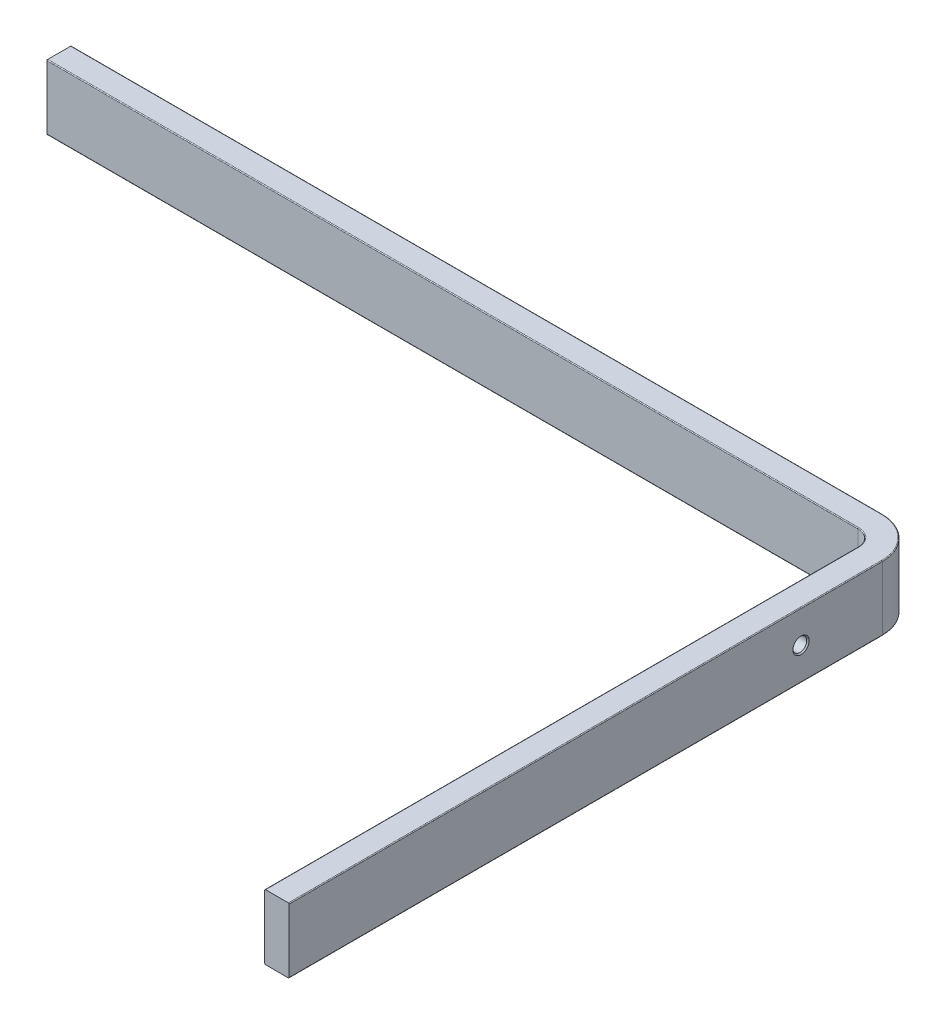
ISO-10303-21;
HEADER;
FILE_DESCRIPTION(('STEP AP214'),'2;1');
FILE_NAME('part.step','',(''),(''),'','','');
FILE_SCHEMA(('AUTOMOTIVE_DESIGN { 1 0 10303 214 1 1 1 1 }'));
ENDSEC;
DATA;
#1=APPLICATION_CONTEXT('core data for automotive mechanical design processes');
#2=APPLICATION_PROTOCOL_DEFINITION('international standard','automotive_design',2000,#1);
#3=PRODUCT_CONTEXT('',#1,'mechanical');
#4=PRODUCT('Part','Part','',(#3));
#5=PRODUCT_RELATED_PRODUCT_CATEGORY('part','',(#4));
#6=PRODUCT_DEFINITION_FORMATION('','',#4);
#7=PRODUCT_DEFINITION_CONTEXT('part definition',#1,'design');
#8=PRODUCT_DEFINITION('design','',#6,#7);
#9=PRODUCT_DEFINITION_SHAPE('','',#8);
#10=(LENGTH_UNIT() NAMED_UNIT(*) SI_UNIT(.MILLI.,.METRE.));
#11=(NAMED_UNIT(*) PLANE_ANGLE_UNIT() SI_UNIT($,.RADIAN.));
#12=(NAMED_UNIT(*) SI_UNIT($,.STERADIAN.) SOLID_ANGLE_UNIT());
#13=UNCERTAINTY_MEASURE_WITH_UNIT(LENGTH_MEASURE(1.E-05),#10,'distance_accuracy_value','');
#14=(GEOMETRIC_REPRESENTATION_CONTEXT(3) GLOBAL_UNCERTAINTY_ASSIGNED_CONTEXT((#13)) GLOBAL_UNIT_ASSIGNED_CONTEXT((#10,
#11,#12)) REPRESENTATION_CONTEXT('',''));
#15=CARTESIAN_POINT('',(0.,0.,0.));
#16=DIRECTION('',(0.,0.,1.));
#17=DIRECTION('',(1.,0.,0.));
#18=AXIS2_PLACEMENT_3D('',#15,#16,#17);
#19=CARTESIAN_POINT('',(0.,-20.,390.));
#20=DIRECTION('',(1.,0.,0.));
#21=DIRECTION('',(0.,0.,-1.));
#22=AXIS2_PLACEMENT_3D('',#19,#20,#21);
#23=PLANE('',#22);
#24=CARTESIAN_POINT('',(0.,0.,75.));
#25=DIRECTION('',(1.,0.,0.));
#26=DIRECTION('',(0.,0.,-1.));
#27=AXIS2_PLACEMENT_3D('',#24,#25,#26);
#28=CIRCLE('',#27,4.99999999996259);
#29=CARTESIAN_POINT('',(0.,0.,70.0000000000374));
#30=VERTEX_POINT('',#29);
#31=EDGE_CURVE('E212',#30,#30,#28,.F.);
#32=ORIENTED_EDGE('',*,*,#31,.T.);
#33=EDGE_LOOP('',(#32));
#34=FACE_BOUND('',#33,.T.);
#35=DIRECTION('',(0.,1.,0.));
#36=VECTOR('',#35,1.);
#37=CARTESIAN_POINT('',(0.,-20.,390.));
#38=LINE('',#37,#36);
#39=CARTESIAN_POINT('',(0.,-19.5,390.));
#40=VERTEX_POINT('',#39);
#41=CARTESIAN_POINT('',(0.,19.5,390.));
#42=VERTEX_POINT('',#41);
#43=EDGE_CURVE('E333',#40,#42,#38,.T.);
#44=ORIENTED_EDGE('',*,*,#43,.F.);
#45=DIRECTION('',(0.,0.,-1.));
#46=VECTOR('',#45,1.);
#47=CARTESIAN_POINT('',(0.,-19.5,25.));
#48=LINE('',#47,#46);
#49=CARTESIAN_POINT('',(0.,-19.5,25.));
#50=VERTEX_POINT('',#49);
#51=EDGE_CURVE('E256',#40,#50,#48,.T.);
#52=ORIENTED_EDGE('',*,*,#51,.T.);
#53=DIRECTION('',(0.,1.,0.));
#54=VECTOR('',#53,1.);
#55=CARTESIAN_POINT('',(0.,-20.,25.));
#56=LINE('',#55,#54);
#57=CARTESIAN_POINT('',(0.,19.5,25.));
#58=VERTEX_POINT('',#57);
#59=EDGE_CURVE('E336',#50,#58,#56,.T.);
#60=ORIENTED_EDGE('',*,*,#59,.T.);
#61=DIRECTION('',(0.,0.,-1.));
#62=VECTOR('',#61,1.);
#63=CARTESIAN_POINT('',(0.,19.5,390.));
#64=LINE('',#63,#62);
#65=EDGE_CURVE('E254',#58,#42,#64,.F.);
#66=ORIENTED_EDGE('',*,*,#65,.T.);
#67=EDGE_LOOP('',(#44,#52,#60,#66));
#68=FACE_BOUND('',#67,.T.);
#69=ADVANCED_FACE('F32',(#34,#68),#23,.T.);
#70=CARTESIAN_POINT('',(-525.,-20.,390.));
#71=DIRECTION('',(0.,0.,1.));
#72=DIRECTION('',(1.,0.,0.));
#73=AXIS2_PLACEMENT_3D('',#70,#71,#72);
#74=PLANE('',#73);
#75=DIRECTION('',(1.,0.,0.));
#76=VECTOR('',#75,1.);
#77=CARTESIAN_POINT('',(-525.,-20.,390.));
#78=LINE('',#77,#76);
#79=CARTESIAN_POINT('',(-14.5,-20.,390.));
#80=VERTEX_POINT('',#79);
#81=CARTESIAN_POINT('',(-0.499999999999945,-20.,390.));
#82=VERTEX_POINT('',#81);
#83=EDGE_CURVE('E344',#80,#82,#78,.T.);
#84=ORIENTED_EDGE('',*,*,#83,.T.);
#85=CARTESIAN_POINT('',(-0.5,-19.5,390.));
#86=DIRECTION('',(0.,0.,1.));
#87=DIRECTION('',(1.,0.,0.));
#88=AXIS2_PLACEMENT_3D('',#85,#86,#87);
#89=CIRCLE('',#88,0.5);
#90=EDGE_CURVE('E264',#82,#40,#89,.T.);
#91=ORIENTED_EDGE('',*,*,#90,.T.);
#92=ORIENTED_EDGE('',*,*,#43,.T.);
#93=CARTESIAN_POINT('',(-0.5,19.5,390.));
#94=DIRECTION('',(0.,0.,1.));
#95=DIRECTION('',(1.,0.,0.));
#96=AXIS2_PLACEMENT_3D('',#93,#94,#95);
#97=CIRCLE('',#96,0.5);
#98=CARTESIAN_POINT('',(-0.499999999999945,20.,390.));
#99=VERTEX_POINT('',#98);
#100=EDGE_CURVE('E258',#42,#99,#97,.T.);
#101=ORIENTED_EDGE('',*,*,#100,.T.);
#102=DIRECTION('',(1.,0.,0.));
#103=VECTOR('',#102,1.);
#104=CARTESIAN_POINT('',(-525.,20.,390.));
#105=LINE('',#104,#103);
#106=CARTESIAN_POINT('',(-14.5,20.,390.));
#107=VERTEX_POINT('',#106);
#108=EDGE_CURVE('E349',#107,#99,#105,.T.);
#109=ORIENTED_EDGE('',*,*,#108,.F.);
#110=CARTESIAN_POINT('',(-14.5,19.5,390.));
#111=DIRECTION('',(0.,0.,1.));
#112=DIRECTION('',(1.,0.,0.));
#113=AXIS2_PLACEMENT_3D('',#110,#111,#112);
#114=CIRCLE('',#113,0.5);
#115=CARTESIAN_POINT('',(-15.,19.5,390.));
#116=VERTEX_POINT('',#115);
#117=EDGE_CURVE('E260',#107,#116,#114,.T.);
#118=ORIENTED_EDGE('',*,*,#117,.T.);
#119=DIRECTION('',(0.,-1.,0.));
#120=VECTOR('',#119,1.);
#121=CARTESIAN_POINT('',(-15.,20.,390.));
#122=LINE('',#121,#120);
#123=CARTESIAN_POINT('',(-15.,-19.5,390.));
#124=VERTEX_POINT('',#123);
#125=EDGE_CURVE('E218',#116,#124,#122,.T.);
#126=ORIENTED_EDGE('',*,*,#125,.T.);
#127=CARTESIAN_POINT('',(-14.5,-19.5,390.));
#128=DIRECTION('',(0.,0.,1.));
#129=DIRECTION('',(1.,0.,0.));
#130=AXIS2_PLACEMENT_3D('',#127,#128,#129);
#131=CIRCLE('',#130,0.5);
#132=EDGE_CURVE('E262',#124,#80,#131,.T.);
#133=ORIENTED_EDGE('',*,*,#132,.T.);
#134=EDGE_LOOP('',(#84,#91,#92,#101,#109,#118,#126,#133));
#135=FACE_BOUND('',#134,.T.);
#136=ADVANCED_FACE('F339',(#135),#74,.T.);
#137=CARTESIAN_POINT('',(-525.,-20.,0.));
#138=DIRECTION('',(-1.,0.,0.));
#139=DIRECTION('',(0.,0.,1.));
#140=AXIS2_PLACEMENT_3D('',#137,#138,#139);
#141=PLANE('',#140);
#142=DIRECTION('',(0.,0.,-1.));
#143=VECTOR('',#142,1.);
#144=CARTESIAN_POINT('',(-525.,18.9999999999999,0.));
#145=LINE('',#144,#143);
#146=CARTESIAN_POINT('',(-525.,18.9999999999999,13.9999999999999));
#147=VERTEX_POINT('',#146);
#148=CARTESIAN_POINT('',(-525.,18.9999999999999,1.00000000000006));
#149=VERTEX_POINT('',#148);
#150=EDGE_CURVE('E198',#147,#149,#145,.T.);
#151=ORIENTED_EDGE('',*,*,#150,.T.);
#152=DIRECTION('',(0.,-1.,0.));
#153=VECTOR('',#152,1.);
#154=CARTESIAN_POINT('',(-525.,-20.,1.00000000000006));
#155=LINE('',#154,#153);
#156=CARTESIAN_POINT('',(-525.,-18.9999999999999,1.00000000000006));
#157=VERTEX_POINT('',#156);
#158=EDGE_CURVE('E178',#149,#157,#155,.T.);
#159=ORIENTED_EDGE('',*,*,#158,.T.);
#160=DIRECTION('',(0.,0.,1.));
#161=VECTOR('',#160,1.);
#162=CARTESIAN_POINT('',(-525.,-18.9999999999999,15.));
#163=LINE('',#162,#161);
#164=CARTESIAN_POINT('',(-525.,-18.9999999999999,13.9999999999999));
#165=VERTEX_POINT('',#164);
#166=EDGE_CURVE('E187',#157,#165,#163,.T.);
#167=ORIENTED_EDGE('',*,*,#166,.T.);
#168=DIRECTION('',(0.,1.,0.));
#169=VECTOR('',#168,1.);
#170=CARTESIAN_POINT('',(-525.,20.,13.9999999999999));
#171=LINE('',#170,#169);
#172=EDGE_CURVE('E193',#165,#147,#171,.T.);
#173=ORIENTED_EDGE('',*,*,#172,.T.);
#174=EDGE_LOOP('',(#151,#159,#167,#173));
#175=FACE_BOUND('',#174,.T.);
#176=ADVANCED_FACE('F196',(#175),#141,.T.);
#177=CARTESIAN_POINT('',(0.,-20.,0.));
#178=DIRECTION('',(0.,0.,-1.));
#179=DIRECTION('',(-1.,0.,0.));
#180=AXIS2_PLACEMENT_3D('',#177,#178,#179);
#181=PLANE('',#180);
#182=DIRECTION('',(0.,1.,0.));
#183=VECTOR('',#182,1.);
#184=CARTESIAN_POINT('',(-25.,-20.,0.));
#185=LINE('',#184,#183);
#186=CARTESIAN_POINT('',(-25.,19.5,0.));
#187=VERTEX_POINT('',#186);
#188=CARTESIAN_POINT('',(-25.,-19.5,0.));
#189=VERTEX_POINT('',#188);
#190=EDGE_CURVE('E356',#187,#189,#185,.F.);
#191=ORIENTED_EDGE('',*,*,#190,.T.);
#192=DIRECTION('',(-1.,0.,0.));
#193=VECTOR('',#192,1.);
#194=CARTESIAN_POINT('',(-524.,-19.5,0.));
#195=LINE('',#194,#193);
#196=CARTESIAN_POINT('',(-524.,-19.5,0.));
#197=VERTEX_POINT('',#196);
#198=EDGE_CURVE('E232',#189,#197,#195,.T.);
#199=ORIENTED_EDGE('',*,*,#198,.T.);
#200=DIRECTION('',(0.,1.,0.));
#201=VECTOR('',#200,1.);
#202=CARTESIAN_POINT('',(-524.,-20.,0.));
#203=LINE('',#202,#201);
#204=CARTESIAN_POINT('',(-524.,19.5,0.));
#205=VERTEX_POINT('',#204);
#206=EDGE_CURVE('E194',#197,#205,#203,.T.);
#207=ORIENTED_EDGE('',*,*,#206,.T.);
#208=DIRECTION('',(-1.,0.,0.));
#209=VECTOR('',#208,1.);
#210=CARTESIAN_POINT('',(0.,19.5,0.));
#211=LINE('',#210,#209);
#212=EDGE_CURVE('E230',#205,#187,#211,.F.);
#213=ORIENTED_EDGE('',*,*,#212,.T.);
#214=EDGE_LOOP('',(#191,#199,#207,#213));
#215=FACE_BOUND('',#214,.T.);
#216=ADVANCED_FACE('F373',(#215),#181,.T.);
#217=CARTESIAN_POINT('',(0.,-20.,0.));
#218=DIRECTION('',(0.,1.,0.));
#219=DIRECTION('',(0.,0.,1.));
#220=AXIS2_PLACEMENT_3D('',#217,#218,#219);
#221=PLANE('',#220);
#222=DIRECTION('',(0.,0.,-1.));
#223=VECTOR('',#222,1.);
#224=CARTESIAN_POINT('',(-524.,-20.,0.));
#225=LINE('',#224,#223);
#226=CARTESIAN_POINT('',(-524.,-20.,14.5));
#227=VERTEX_POINT('',#226);
#228=CARTESIAN_POINT('',(-524.,-20.,0.5));
#229=VERTEX_POINT('',#228);
#230=EDGE_CURVE('E209',#227,#229,#225,.T.);
#231=ORIENTED_EDGE('',*,*,#230,.T.);
#232=DIRECTION('',(-1.,0.,0.));
#233=VECTOR('',#232,1.);
#234=CARTESIAN_POINT('',(-25.,-20.,0.5));
#235=LINE('',#234,#233);
#236=CARTESIAN_POINT('',(-25.,-20.,0.500000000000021));
#237=VERTEX_POINT('',#236);
#238=EDGE_CURVE('E252',#229,#237,#235,.F.);
#239=ORIENTED_EDGE('',*,*,#238,.T.);
#240=CARTESIAN_POINT('',(-25.,-20.,25.));
#241=DIRECTION('',(0.,1.,0.));
#242=DIRECTION('',(0.,0.,1.));
#243=AXIS2_PLACEMENT_3D('',#240,#241,#242);
#244=CIRCLE('',#243,24.5);
#245=CARTESIAN_POINT('',(-0.5,-20.,25.));
#246=VERTEX_POINT('',#245);
#247=EDGE_CURVE('E248',#237,#246,#244,.F.);
#248=ORIENTED_EDGE('',*,*,#247,.T.);
#249=DIRECTION('',(0.,0.,-1.));
#250=VECTOR('',#249,1.);
#251=CARTESIAN_POINT('',(-0.5,-20.,390.));
#252=LINE('',#251,#250);
#253=EDGE_CURVE('E250',#246,#82,#252,.F.);
#254=ORIENTED_EDGE('',*,*,#253,.T.);
#255=ORIENTED_EDGE('',*,*,#83,.F.);
#256=DIRECTION('',(0.,0.,1.));
#257=VECTOR('',#256,1.);
#258=CARTESIAN_POINT('',(-14.5,-20.,0.));
#259=LINE('',#258,#257);
#260=CARTESIAN_POINT('',(-14.5,-20.,25.));
#261=VERTEX_POINT('',#260);
#262=EDGE_CURVE('E242',#80,#261,#259,.F.);
#263=ORIENTED_EDGE('',*,*,#262,.T.);
#264=CARTESIAN_POINT('',(-25.,-20.,25.));
#265=DIRECTION('',(0.,1.,0.));
#266=DIRECTION('',(0.,0.,1.));
#267=AXIS2_PLACEMENT_3D('',#264,#265,#266);
#268=CIRCLE('',#267,10.5);
#269=CARTESIAN_POINT('',(-25.,-20.,14.5));
#270=VERTEX_POINT('',#269);
#271=EDGE_CURVE('E244',#261,#270,#268,.T.);
#272=ORIENTED_EDGE('',*,*,#271,.T.);
#273=DIRECTION('',(1.,0.,0.));
#274=VECTOR('',#273,1.);
#275=CARTESIAN_POINT('',(0.,-20.,14.5));
#276=LINE('',#275,#274);
#277=EDGE_CURVE('E246',#270,#227,#276,.F.);
#278=ORIENTED_EDGE('',*,*,#277,.T.);
#279=EDGE_LOOP('',(#231,#239,#248,#254,#255,#263,#272,#278));
#280=FACE_BOUND('',#279,.T.);
#281=ADVANCED_FACE('F389',(#280),#221,.F.);
#282=CARTESIAN_POINT('',(0.,20.,0.));
#283=DIRECTION('',(0.,1.,0.));
#284=DIRECTION('',(0.,0.,1.));
#285=AXIS2_PLACEMENT_3D('',#282,#283,#284);
#286=PLANE('',#285);
#287=DIRECTION('',(0.,0.,1.));
#288=VECTOR('',#287,1.);
#289=CARTESIAN_POINT('',(-524.,20.,0.));
#290=LINE('',#289,#288);
#291=CARTESIAN_POINT('',(-524.,20.,0.5));
#292=VERTEX_POINT('',#291);
#293=CARTESIAN_POINT('',(-524.,20.,14.5));
#294=VERTEX_POINT('',#293);
#295=EDGE_CURVE('E199',#292,#294,#290,.T.);
#296=ORIENTED_EDGE('',*,*,#295,.T.);
#297=DIRECTION('',(1.,0.,0.));
#298=VECTOR('',#297,1.);
#299=CARTESIAN_POINT('',(-25.,20.,14.5));
#300=LINE('',#299,#298);
#301=CARTESIAN_POINT('',(-25.,20.,14.5));
#302=VERTEX_POINT('',#301);
#303=EDGE_CURVE('E297',#294,#302,#300,.T.);
#304=ORIENTED_EDGE('',*,*,#303,.T.);
#305=CARTESIAN_POINT('',(-25.,20.,25.));
#306=DIRECTION('',(0.,1.,0.));
#307=DIRECTION('',(0.,0.,1.));
#308=AXIS2_PLACEMENT_3D('',#305,#306,#307);
#309=CIRCLE('',#308,10.5);
#310=CARTESIAN_POINT('',(-14.5,20.,25.));
#311=VERTEX_POINT('',#310);
#312=EDGE_CURVE('E49',#302,#311,#309,.F.);
#313=ORIENTED_EDGE('',*,*,#312,.T.);
#314=DIRECTION('',(0.,0.,1.));
#315=VECTOR('',#314,1.);
#316=CARTESIAN_POINT('',(-14.5,20.,390.));
#317=LINE('',#316,#315);
#318=EDGE_CURVE('E295',#311,#107,#317,.T.);
#319=ORIENTED_EDGE('',*,*,#318,.T.);
#320=ORIENTED_EDGE('',*,*,#108,.T.);
#321=DIRECTION('',(0.,0.,-1.));
#322=VECTOR('',#321,1.);
#323=CARTESIAN_POINT('',(-0.5,20.,0.));
#324=LINE('',#323,#322);
#325=CARTESIAN_POINT('',(-0.5,20.,25.));
#326=VERTEX_POINT('',#325);
#327=EDGE_CURVE('E287',#99,#326,#324,.T.);
#328=ORIENTED_EDGE('',*,*,#327,.T.);
#329=CARTESIAN_POINT('',(-25.,20.,25.));
#330=DIRECTION('',(0.,1.,0.));
#331=DIRECTION('',(0.,0.,1.));
#332=AXIS2_PLACEMENT_3D('',#329,#330,#331);
#333=CIRCLE('',#332,24.5);
#334=CARTESIAN_POINT('',(-25.,20.,0.500000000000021));
#335=VERTEX_POINT('',#334);
#336=EDGE_CURVE('E289',#326,#335,#333,.T.);
#337=ORIENTED_EDGE('',*,*,#336,.T.);
#338=DIRECTION('',(-1.,0.,0.));
#339=VECTOR('',#338,1.);
#340=CARTESIAN_POINT('',(0.,20.,0.5));
#341=LINE('',#340,#339);
#342=EDGE_CURVE('E291',#335,#292,#341,.T.);
#343=ORIENTED_EDGE('',*,*,#342,.T.);
#344=EDGE_LOOP('',(#296,#304,#313,#319,#320,#328,#337,#343));
#345=FACE_BOUND('',#344,.T.);
#346=ADVANCED_FACE('F411',(#345),#286,.T.);
#347=CARTESIAN_POINT('',(-15.,20.,15.));
#348=DIRECTION('',(1.,0.,0.));
#349=DIRECTION('',(0.,0.,-1.));
#350=AXIS2_PLACEMENT_3D('',#347,#348,#349);
#351=PLANE('',#350);
#352=CARTESIAN_POINT('',(-15.,0.,75.));
#353=DIRECTION('',(1.,0.,0.));
#354=DIRECTION('',(0.,0.,-1.));
#355=AXIS2_PLACEMENT_3D('',#352,#353,#354);
#356=CIRCLE('',#355,4.99999999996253);
#357=CARTESIAN_POINT('',(-15.,0.,70.0000000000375));
#358=VERTEX_POINT('',#357);
#359=EDGE_CURVE('E227',#358,#358,#356,.T.);
#360=ORIENTED_EDGE('',*,*,#359,.T.);
#361=EDGE_LOOP('',(#360));
#362=FACE_BOUND('',#361,.T.);
#363=DIRECTION('',(0.,-1.,0.));
#364=VECTOR('',#363,1.);
#365=CARTESIAN_POINT('',(-15.,-20.,25.));
#366=LINE('',#365,#364);
#367=CARTESIAN_POINT('',(-15.,19.5,25.));
#368=VERTEX_POINT('',#367);
#369=CARTESIAN_POINT('',(-15.,-19.5,25.));
#370=VERTEX_POINT('',#369);
#371=EDGE_CURVE('E343',#368,#370,#366,.T.);
#372=ORIENTED_EDGE('',*,*,#371,.T.);
#373=DIRECTION('',(0.,0.,1.));
#374=VECTOR('',#373,1.);
#375=CARTESIAN_POINT('',(-15.,-19.5,15.));
#376=LINE('',#375,#374);
#377=EDGE_CURVE('E285',#370,#124,#376,.T.);
#378=ORIENTED_EDGE('',*,*,#377,.T.);
#379=ORIENTED_EDGE('',*,*,#125,.F.);
#380=DIRECTION('',(0.,0.,1.));
#381=VECTOR('',#380,1.);
#382=CARTESIAN_POINT('',(-15.,19.5,25.));
#383=LINE('',#382,#381);
#384=EDGE_CURVE('E283',#116,#368,#383,.F.);
#385=ORIENTED_EDGE('',*,*,#384,.T.);
#386=EDGE_LOOP('',(#372,#378,#379,#385));
#387=FACE_BOUND('',#386,.T.);
#388=ADVANCED_FACE('F481',(#362,#387),#351,.F.);
#389=CARTESIAN_POINT('',(-525.,20.,15.));
#390=DIRECTION('',(0.,0.,-1.));
#391=DIRECTION('',(-1.,0.,0.));
#392=AXIS2_PLACEMENT_3D('',#389,#390,#391);
#393=PLANE('',#392);
#394=DIRECTION('',(0.,-1.,0.));
#395=VECTOR('',#394,1.);
#396=CARTESIAN_POINT('',(-524.,-20.,15.));
#397=LINE('',#396,#395);
#398=CARTESIAN_POINT('',(-524.,19.5,15.));
#399=VERTEX_POINT('',#398);
#400=CARTESIAN_POINT('',(-524.,-19.5,15.));
#401=VERTEX_POINT('',#400);
#402=EDGE_CURVE('E202',#399,#401,#397,.T.);
#403=ORIENTED_EDGE('',*,*,#402,.T.);
#404=DIRECTION('',(1.,0.,0.));
#405=VECTOR('',#404,1.);
#406=CARTESIAN_POINT('',(-525.,-19.5,15.));
#407=LINE('',#406,#405);
#408=CARTESIAN_POINT('',(-25.,-19.5,15.));
#409=VERTEX_POINT('',#408);
#410=EDGE_CURVE('E272',#401,#409,#407,.T.);
#411=ORIENTED_EDGE('',*,*,#410,.T.);
#412=DIRECTION('',(0.,-1.,0.));
#413=VECTOR('',#412,1.);
#414=CARTESIAN_POINT('',(-25.,20.,15.));
#415=LINE('',#414,#413);
#416=CARTESIAN_POINT('',(-25.,19.5,15.));
#417=VERTEX_POINT('',#416);
#418=EDGE_CURVE('E347',#409,#417,#415,.F.);
#419=ORIENTED_EDGE('',*,*,#418,.T.);
#420=DIRECTION('',(1.,0.,0.));
#421=VECTOR('',#420,1.);
#422=CARTESIAN_POINT('',(-524.,19.5,15.));
#423=LINE('',#422,#421);
#424=EDGE_CURVE('E270',#417,#399,#423,.F.);
#425=ORIENTED_EDGE('',*,*,#424,.T.);
#426=EDGE_LOOP('',(#403,#411,#419,#425));
#427=FACE_BOUND('',#426,.T.);
#428=ADVANCED_FACE('F405',(#427),#393,.F.);
#429=CARTESIAN_POINT('',(-15.,0.,75.));
#430=DIRECTION('',(-1.,0.,0.));
#431=DIRECTION('',(0.,0.,1.));
#432=AXIS2_PLACEMENT_3D('',#429,#430,#431);
#433=CYLINDRICAL_SURFACE('',#432,4.24999999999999);
#434=CARTESIAN_POINT('',(-0.7499999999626,0.,75.));
#435=DIRECTION('',(1.,0.,0.));
#436=DIRECTION('',(0.,0.,-1.));
#437=AXIS2_PLACEMENT_3D('',#434,#435,#436);
#438=CIRCLE('',#437,4.24999999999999);
#439=CARTESIAN_POINT('',(-0.7499999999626,0.,70.75));
#440=VERTEX_POINT('',#439);
#441=EDGE_CURVE('E224',#440,#440,#438,.T.);
#442=ORIENTED_EDGE('',*,*,#441,.T.);
#443=EDGE_LOOP('',(#442));
#444=FACE_BOUND('',#443,.T.);
#445=CARTESIAN_POINT('',(-14.2500000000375,0.,75.));
#446=DIRECTION('',(1.,0.,0.));
#447=DIRECTION('',(0.,0.,-1.));
#448=AXIS2_PLACEMENT_3D('',#445,#446,#447);
#449=CIRCLE('',#448,4.24999999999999);
#450=CARTESIAN_POINT('',(-14.2500000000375,0.,70.75));
#451=VERTEX_POINT('',#450);
#452=EDGE_CURVE('E221',#451,#451,#449,.F.);
#453=ORIENTED_EDGE('',*,*,#452,.T.);
#454=EDGE_LOOP('',(#453));
#455=FACE_BOUND('',#454,.T.);
#456=ADVANCED_FACE('F434',(#444,#455),#433,.F.);
#457=CARTESIAN_POINT('',(-25.,20.,25.));
#458=DIRECTION('',(0.,1.,0.));
#459=DIRECTION('',(0.,0.,1.));
#460=AXIS2_PLACEMENT_3D('',#457,#458,#459);
#461=CYLINDRICAL_SURFACE('',#460,10.);
#462=ORIENTED_EDGE('',*,*,#418,.F.);
#463=CARTESIAN_POINT('',(-25.,-19.5,25.));
#464=DIRECTION('',(0.,1.,0.));
#465=DIRECTION('',(0.,0.,1.));
#466=AXIS2_PLACEMENT_3D('',#463,#464,#465);
#467=CIRCLE('',#466,10.);
#468=EDGE_CURVE('E281',#409,#370,#467,.F.);
#469=ORIENTED_EDGE('',*,*,#468,.T.);
#470=ORIENTED_EDGE('',*,*,#371,.F.);
#471=CARTESIAN_POINT('',(-25.,19.5,25.));
#472=DIRECTION('',(0.,1.,0.));
#473=DIRECTION('',(0.,0.,1.));
#474=AXIS2_PLACEMENT_3D('',#471,#472,#473);
#475=CIRCLE('',#474,10.);
#476=EDGE_CURVE('E279',#368,#417,#475,.T.);
#477=ORIENTED_EDGE('',*,*,#476,.T.);
#478=EDGE_LOOP('',(#462,#469,#470,#477));
#479=FACE_BOUND('',#478,.T.);
#480=ADVANCED_FACE('F406',(#479),#461,.F.);
#481=CARTESIAN_POINT('',(-25.,-20.,25.));
#482=DIRECTION('',(0.,1.,0.));
#483=DIRECTION('',(0.,0.,1.));
#484=AXIS2_PLACEMENT_3D('',#481,#482,#483);
#485=CYLINDRICAL_SURFACE('',#484,25.);
#486=ORIENTED_EDGE('',*,*,#59,.F.);
#487=CARTESIAN_POINT('',(-25.,-19.5,25.));
#488=DIRECTION('',(0.,1.,0.));
#489=DIRECTION('',(0.,0.,1.));
#490=AXIS2_PLACEMENT_3D('',#487,#488,#489);
#491=CIRCLE('',#490,25.);
#492=EDGE_CURVE('E268',#50,#189,#491,.T.);
#493=ORIENTED_EDGE('',*,*,#492,.T.);
#494=ORIENTED_EDGE('',*,*,#190,.F.);
#495=CARTESIAN_POINT('',(-25.,19.5,25.));
#496=DIRECTION('',(0.,1.,0.));
#497=DIRECTION('',(0.,0.,1.));
#498=AXIS2_PLACEMENT_3D('',#495,#496,#497);
#499=CIRCLE('',#498,25.);
#500=EDGE_CURVE('E266',#187,#58,#499,.F.);
#501=ORIENTED_EDGE('',*,*,#500,.T.);
#502=EDGE_LOOP('',(#486,#493,#494,#501));
#503=FACE_BOUND('',#502,.T.);
#504=ADVANCED_FACE('F376',(#503),#485,.T.);
#505=CARTESIAN_POINT('',(-524.,20.,15.));
#506=DIRECTION('',(-0.707106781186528,0.,0.707106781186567));
#507=DIRECTION('',(0.,1.,0.));
#508=AXIS2_PLACEMENT_3D('',#505,#506,#507);
#509=PLANE('',#508);
#510=DIRECTION('',(-0.577350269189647,0.577350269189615,-0.577350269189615));
#511=VECTOR('',#510,1.);
#512=CARTESIAN_POINT('',(-529.666666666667,-14.3333333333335,9.33333333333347));
#513=LINE('',#512,#511);
#514=CARTESIAN_POINT('',(-524.146446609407,-19.8535533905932,14.8535533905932));
#515=VERTEX_POINT('',#514);
#516=EDGE_CURVE('E190',#515,#165,#513,.T.);
#517=ORIENTED_EDGE('',*,*,#516,.F.);
#518=CARTESIAN_POINT('',(-524.5,-19.5,14.5));
#519=DIRECTION('',(-0.707106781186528,0.,0.707106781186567));
#520=DIRECTION('',(0.707106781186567,0.,0.707106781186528));
#521=AXIS2_PLACEMENT_3D('',#518,#519,#520);
#522=ELLIPSE('',#521,0.707106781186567,0.5);
#523=EDGE_CURVE('E277',#515,#401,#522,.T.);
#524=ORIENTED_EDGE('',*,*,#523,.T.);
#525=ORIENTED_EDGE('',*,*,#402,.F.);
#526=CARTESIAN_POINT('',(-524.5,19.5,14.5));
#527=DIRECTION('',(-0.707106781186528,0.,0.707106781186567));
#528=DIRECTION('',(-0.707106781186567,0.,-0.707106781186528));
#529=AXIS2_PLACEMENT_3D('',#526,#527,#528);
#530=ELLIPSE('',#529,0.707106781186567,0.5);
#531=CARTESIAN_POINT('',(-524.146446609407,19.8535533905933,14.8535533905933));
#532=VERTEX_POINT('',#531);
#533=EDGE_CURVE('E275',#399,#532,#530,.T.);
#534=ORIENTED_EDGE('',*,*,#533,.T.);
#535=DIRECTION('',(0.577350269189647,0.577350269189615,0.577350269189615));
#536=VECTOR('',#535,1.);
#537=CARTESIAN_POINT('',(-524.,20.,15.));
#538=LINE('',#537,#536);
#539=EDGE_CURVE('E183',#147,#532,#538,.T.);
#540=ORIENTED_EDGE('',*,*,#539,.F.);
#541=ORIENTED_EDGE('',*,*,#172,.F.);
#542=EDGE_LOOP('',(#517,#524,#525,#534,#540,#541));
#543=FACE_BOUND('',#542,.T.);
#544=ADVANCED_FACE('F362',(#543),#509,.T.);
#545=CARTESIAN_POINT('',(-525.,-18.9999999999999,0.));
#546=DIRECTION('',(-0.707106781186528,-0.707106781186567,0.));
#547=DIRECTION('',(0.,0.,-1.));
#548=AXIS2_PLACEMENT_3D('',#545,#546,#547);
#549=PLANE('',#548);
#550=DIRECTION('',(-0.577350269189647,0.577350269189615,0.577350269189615));
#551=VECTOR('',#550,1.);
#552=CARTESIAN_POINT('',(-524.666666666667,-19.3333333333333,0.666666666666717));
#553=LINE('',#552,#551);
#554=CARTESIAN_POINT('',(-524.146446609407,-19.8535533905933,0.146446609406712));
#555=VERTEX_POINT('',#554);
#556=EDGE_CURVE('E172',#555,#157,#553,.T.);
#557=ORIENTED_EDGE('',*,*,#556,.F.);
#558=CARTESIAN_POINT('',(-524.5,-19.5,0.5));
#559=DIRECTION('',(-0.707106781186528,-0.707106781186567,0.));
#560=DIRECTION('',(0.707106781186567,-0.707106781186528,0.));
#561=AXIS2_PLACEMENT_3D('',#558,#559,#560);
#562=ELLIPSE('',#561,0.707106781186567,0.5);
#563=EDGE_CURVE('E240',#555,#229,#562,.T.);
#564=ORIENTED_EDGE('',*,*,#563,.T.);
#565=ORIENTED_EDGE('',*,*,#230,.F.);
#566=CARTESIAN_POINT('',(-524.5,-19.5,14.5));
#567=DIRECTION('',(-0.707106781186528,-0.707106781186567,0.));
#568=DIRECTION('',(0.707106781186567,-0.707106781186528,0.));
#569=AXIS2_PLACEMENT_3D('',#566,#567,#568);
#570=ELLIPSE('',#569,0.707106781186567,0.5);
#571=EDGE_CURVE('E238',#227,#515,#570,.T.);
#572=ORIENTED_EDGE('',*,*,#571,.T.);
#573=ORIENTED_EDGE('',*,*,#516,.T.);
#574=ORIENTED_EDGE('',*,*,#166,.F.);
#575=EDGE_LOOP('',(#557,#564,#565,#572,#573,#574));
#576=FACE_BOUND('',#575,.T.);
#577=ADVANCED_FACE('F188',(#576),#549,.T.);
#578=CARTESIAN_POINT('',(-524.,20.,0.));
#579=DIRECTION('',(0.707106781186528,-0.707106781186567,0.));
#580=DIRECTION('',(0.,0.,1.));
#581=AXIS2_PLACEMENT_3D('',#578,#579,#580);
#582=PLANE('',#581);
#583=ORIENTED_EDGE('',*,*,#539,.T.);
#584=CARTESIAN_POINT('',(-524.5,19.5,14.5));
#585=DIRECTION('',(0.707106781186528,-0.707106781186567,0.));
#586=DIRECTION('',(-0.707106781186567,-0.707106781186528,0.));
#587=AXIS2_PLACEMENT_3D('',#584,#585,#586);
#588=ELLIPSE('',#587,0.707106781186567,0.5);
#589=EDGE_CURVE('E11',#532,#294,#588,.F.);
#590=ORIENTED_EDGE('',*,*,#589,.T.);
#591=ORIENTED_EDGE('',*,*,#295,.F.);
#592=CARTESIAN_POINT('',(-524.5,19.5,0.5));
#593=DIRECTION('',(0.707106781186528,-0.707106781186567,0.));
#594=DIRECTION('',(-0.707106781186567,-0.707106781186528,0.));
#595=AXIS2_PLACEMENT_3D('',#592,#593,#594);
#596=ELLIPSE('',#595,0.707106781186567,0.5);
#597=CARTESIAN_POINT('',(-524.146446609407,19.8535533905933,0.146446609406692));
#598=VERTEX_POINT('',#597);
#599=EDGE_CURVE('E41',#292,#598,#596,.F.);
#600=ORIENTED_EDGE('',*,*,#599,.T.);
#601=DIRECTION('',(-0.577350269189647,-0.577350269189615,0.577350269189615));
#602=VECTOR('',#601,1.);
#603=CARTESIAN_POINT('',(-524.,20.,0.));
#604=LINE('',#603,#602);
#605=EDGE_CURVE('E184',#149,#598,#604,.F.);
#606=ORIENTED_EDGE('',*,*,#605,.F.);
#607=ORIENTED_EDGE('',*,*,#150,.F.);
#608=EDGE_LOOP('',(#583,#590,#591,#600,#606,#607));
#609=FACE_BOUND('',#608,.T.);
#610=ADVANCED_FACE('F367',(#609),#582,.F.);
#611=CARTESIAN_POINT('',(-524.,-20.,0.));
#612=DIRECTION('',(0.707106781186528,0.,0.707106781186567));
#613=DIRECTION('',(0.,1.,0.));
#614=AXIS2_PLACEMENT_3D('',#611,#612,#613);
#615=PLANE('',#614);
#616=ORIENTED_EDGE('',*,*,#206,.F.);
#617=CARTESIAN_POINT('',(-524.5,-19.5,0.5));
#618=DIRECTION('',(0.707106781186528,0.,0.707106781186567));
#619=DIRECTION('',(0.707106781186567,0.,-0.707106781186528));
#620=AXIS2_PLACEMENT_3D('',#617,#618,#619);
#621=ELLIPSE('',#620,0.707106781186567,0.5);
#622=EDGE_CURVE('E180',#197,#555,#621,.F.);
#623=ORIENTED_EDGE('',*,*,#622,.T.);
#624=ORIENTED_EDGE('',*,*,#556,.T.);
#625=ORIENTED_EDGE('',*,*,#158,.F.);
#626=ORIENTED_EDGE('',*,*,#605,.T.);
#627=CARTESIAN_POINT('',(-524.5,19.5,0.5));
#628=DIRECTION('',(0.707106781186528,0.,0.707106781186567));
#629=DIRECTION('',(-0.707106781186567,0.,0.707106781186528));
#630=AXIS2_PLACEMENT_3D('',#627,#628,#629);
#631=ELLIPSE('',#630,0.707106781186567,0.5);
#632=EDGE_CURVE('E235',#598,#205,#631,.F.);
#633=ORIENTED_EDGE('',*,*,#632,.T.);
#634=EDGE_LOOP('',(#616,#623,#624,#625,#626,#633));
#635=FACE_BOUND('',#634,.T.);
#636=ADVANCED_FACE('F175',(#635),#615,.F.);
#637=CARTESIAN_POINT('',(0.,0.,75.));
#638=DIRECTION('',(1.,0.,0.));
#639=DIRECTION('',(0.,0.,-1.));
#640=AXIS2_PLACEMENT_3D('',#637,#638,#639);
#641=CONICAL_SURFACE('',#640,4.99999999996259,0.785398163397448);
#642=CARTESIAN_POINT('',(-0.7499999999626,0.,70.75));
#643=CARTESIAN_POINT('',(-0.742187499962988,0.,70.7421875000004));
#644=CARTESIAN_POINT('',(-0.734374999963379,0.,70.7343750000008));
#645=CARTESIAN_POINT('',(-0.718749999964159,0.,70.7187500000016));
#646=CARTESIAN_POINT('',(-0.71093749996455,0.,70.7109375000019));
#647=CARTESIAN_POINT('',(-0.695312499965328,0.,70.6953125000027));
#648=CARTESIAN_POINT('',(-0.687499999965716,0.,70.6875000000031));
#649=CARTESIAN_POINT('',(-0.671874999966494,0.,70.6718750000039));
#650=CARTESIAN_POINT('',(-0.664062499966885,0.,70.6640625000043));
#651=CARTESIAN_POINT('',(-0.648437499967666,0.,70.6484375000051));
#652=CARTESIAN_POINT('',(-0.640624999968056,0.,70.6406250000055));
#653=CARTESIAN_POINT('',(-0.624999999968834,0.,70.6250000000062));
#654=CARTESIAN_POINT('',(-0.617187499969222,0.,70.6171875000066));
#655=CARTESIAN_POINT('',(-0.601562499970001,0.,70.6015625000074));
#656=CARTESIAN_POINT('',(-0.593749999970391,0.,70.5937500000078));
#657=CARTESIAN_POINT('',(-0.578124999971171,0.,70.5781250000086));
#658=CARTESIAN_POINT('',(-0.57031249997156,0.,70.570312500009));
#659=CARTESIAN_POINT('',(-0.55468749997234,0.,70.5546875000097));
#660=CARTESIAN_POINT('',(-0.546874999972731,0.,70.5468750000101));
#661=CARTESIAN_POINT('',(-0.531249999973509,0.,70.5312500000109));
#662=CARTESIAN_POINT('',(-0.523437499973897,0.,70.5234375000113));
#663=CARTESIAN_POINT('',(-0.507812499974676,0.,70.5078125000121));
#664=CARTESIAN_POINT('',(-0.499999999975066,0.,70.5000000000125));
#665=CARTESIAN_POINT('',(-0.484374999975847,0.,70.4843750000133));
#666=CARTESIAN_POINT('',(-0.476562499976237,0.,70.4765625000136));
#667=CARTESIAN_POINT('',(-0.460937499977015,0.,70.4609375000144));
#668=CARTESIAN_POINT('',(-0.453124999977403,0.,70.4531250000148));
#669=CARTESIAN_POINT('',(-0.437499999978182,0.,70.4375000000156));
#670=CARTESIAN_POINT('',(-0.429687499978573,0.,70.429687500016));
#671=CARTESIAN_POINT('',(-0.414062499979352,0.,70.4140625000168));
#672=CARTESIAN_POINT('',(-0.406249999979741,0.,70.4062500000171));
#673=CARTESIAN_POINT('',(-0.390624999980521,0.,70.3906250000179));
#674=CARTESIAN_POINT('',(-0.382812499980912,0.,70.3828125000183));
#675=CARTESIAN_POINT('',(-0.367187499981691,0.,70.3671875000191));
#676=CARTESIAN_POINT('',(-0.359374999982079,0.,70.3593750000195));
#677=CARTESIAN_POINT('',(-0.343749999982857,0.,70.3437500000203));
#678=CARTESIAN_POINT('',(-0.335937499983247,0.,70.3359375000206));
#679=CARTESIAN_POINT('',(-0.320312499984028,0.,70.3203125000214));
#680=CARTESIAN_POINT('',(-0.312499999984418,0.,70.3125000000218));
#681=CARTESIAN_POINT('',(-0.296874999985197,0.,70.2968750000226));
#682=CARTESIAN_POINT('',(-0.289062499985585,0.,70.289062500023));
#683=CARTESIAN_POINT('',(-0.273437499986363,0.,70.2734375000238));
#684=CARTESIAN_POINT('',(-0.265624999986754,0.,70.2656250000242));
#685=CARTESIAN_POINT('',(-0.249999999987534,0.,70.2500000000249));
#686=CARTESIAN_POINT('',(-0.242187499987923,0.,70.2421875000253));
#687=CARTESIAN_POINT('',(-0.226562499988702,0.,70.2265625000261));
#688=CARTESIAN_POINT('',(-0.218749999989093,0.,70.2187500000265));
#689=CARTESIAN_POINT('',(-0.203124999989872,0.,70.2031250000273));
#690=CARTESIAN_POINT('',(-0.19531249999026,0.,70.1953125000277));
#691=CARTESIAN_POINT('',(-0.179687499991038,0.,70.1796875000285));
#692=CARTESIAN_POINT('',(-0.171874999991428,0.,70.1718750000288));
#693=CARTESIAN_POINT('',(-0.156249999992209,0.,70.1562500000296));
#694=CARTESIAN_POINT('',(-0.148437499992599,0.,70.14843750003));
#695=CARTESIAN_POINT('',(-0.132812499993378,0.,70.1328125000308));
#696=CARTESIAN_POINT('',(-0.124999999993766,0.,70.1250000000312));
#697=CARTESIAN_POINT('',(-0.109374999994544,0.,70.109375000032));
#698=CARTESIAN_POINT('',(-0.101562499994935,0.,70.1015625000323));
#699=CARTESIAN_POINT('',(-0.0859374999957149,0.,70.0859375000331));
#700=CARTESIAN_POINT('',(-0.0781249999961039,0.,70.0781250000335));
#701=CARTESIAN_POINT('',(-0.0624999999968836,0.,70.0625000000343));
#702=CARTESIAN_POINT('',(-0.0546874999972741,0.,70.0546875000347));
#703=CARTESIAN_POINT('',(-0.0390624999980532,0.,70.0390625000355));
#704=CARTESIAN_POINT('',(-0.0312499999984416,0.,70.0312500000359));
#705=CARTESIAN_POINT('',(-0.0156249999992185,0.,70.0156250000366));
#706=CARTESIAN_POINT('',(-0.00781249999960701,0.,70.007812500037));
#707=CARTESIAN_POINT('',(0.,0.,70.0000000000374));
#708=B_SPLINE_CURVE_WITH_KNOTS('',3,(#642,#643,#644,#645,#646,#647,#648,#649,#650,#651,#652,
#653,#654,#655,#656,#657,#658,#659,#660,#661,#662,#663,#664,#665,#666,#667,#668,#669,#670,#671,
#672,#673,#674,#675,#676,#677,#678,#679,#680,#681,#682,#683,#684,#685,#686,#687,#688,#689,#690,
#691,#692,#693,#694,#695,#696,#697,#698,#699,#700,#701,#702,#703,#704,#705,#706,#707),
.UNSPECIFIED.,.F.,.F.,(4,2,2,2,2,2,2,2,2,2,2,2,2,2,2,2,2,2,2,2,2,2,2,2,2,2,2,2,2,2,2,2,4),(0.,
0.0331456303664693,0.0662912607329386,0.0994368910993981,0.132582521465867,0.165728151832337,
0.198873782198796,0.232019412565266,0.265165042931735,0.298310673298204,0.331456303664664,
0.364601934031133,0.397747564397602,0.430893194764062,0.464038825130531,0.497184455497,
0.53033008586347,0.563475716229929,0.596621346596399,0.629766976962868,0.662912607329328,
0.696058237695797,0.729203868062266,0.762349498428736,0.795495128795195,0.828640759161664,
0.861786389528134,0.894932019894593,0.928077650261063,0.961223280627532,0.994368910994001,
1.02751454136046,1.06066017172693),.UNSPECIFIED.);
#709=EDGE_CURVE('BSEAM439',#440,#30,#708,.T.);
#710=ORIENTED_EDGE('',*,*,#441,.F.);
#711=ORIENTED_EDGE('',*,*,#31,.F.);
#712=ORIENTED_EDGE('',*,*,#709,.T.);
#713=ORIENTED_EDGE('',*,*,#709,.F.);
#714=EDGE_LOOP('',(#710,#712,#711,#713));
#715=FACE_BOUND('',#714,.T.);
#716=ADVANCED_FACE('F439',(#715),#641,.F.);
#717=CARTESIAN_POINT('',(-14.2500000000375,0.,75.));
#718=DIRECTION('',(-1.,0.,0.));
#719=DIRECTION('',(0.,0.,1.));
#720=AXIS2_PLACEMENT_3D('',#717,#718,#719);
#721=CONICAL_SURFACE('',#720,4.24999999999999,0.785398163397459);
#722=ORIENTED_EDGE('',*,*,#359,.F.);
#723=EDGE_LOOP('',(#722));
#724=FACE_BOUND('',#723,.T.);
#725=ORIENTED_EDGE('',*,*,#452,.F.);
#726=EDGE_LOOP('',(#725));
#727=FACE_BOUND('',#726,.T.);
#728=ADVANCED_FACE('F448',(#724,#727),#721,.F.);
#729=CARTESIAN_POINT('',(-0.5,-19.5,390.));
#730=DIRECTION('',(0.,0.,1.));
#731=DIRECTION('',(1.,0.,0.));
#732=AXIS2_PLACEMENT_3D('',#729,#730,#731);
#733=CYLINDRICAL_SURFACE('',#732,0.5);
#734=ORIENTED_EDGE('',*,*,#90,.F.);
#735=ORIENTED_EDGE('',*,*,#253,.F.);
#736=CARTESIAN_POINT('',(-0.5,-19.5,25.));
#737=DIRECTION('',(0.,0.,-1.));
#738=DIRECTION('',(-1.,0.,0.));
#739=AXIS2_PLACEMENT_3D('',#736,#737,#738);
#740=CIRCLE('',#739,0.5);
#741=EDGE_CURVE('E213',#50,#246,#740,.T.);
#742=ORIENTED_EDGE('',*,*,#741,.F.);
#743=ORIENTED_EDGE('',*,*,#51,.F.);
#744=EDGE_LOOP('',(#734,#735,#742,#743));
#745=FACE_BOUND('',#744,.T.);
#746=ADVANCED_FACE('F452',(#745),#733,.T.);
#747=CARTESIAN_POINT('',(-25.,-19.5,25.));
#748=DIRECTION('',(0.,1.,0.));
#749=DIRECTION('',(0.,0.,1.));
#750=AXIS2_PLACEMENT_3D('',#747,#748,#749);
#751=TOROIDAL_SURFACE('',#750,24.5,0.5);
#752=ORIENTED_EDGE('',*,*,#741,.T.);
#753=ORIENTED_EDGE('',*,*,#247,.F.);
#754=CARTESIAN_POINT('',(-25.,-19.5,0.500000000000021));
#755=DIRECTION('',(-1.,0.,0.));
#756=DIRECTION('',(0.,0.,1.));
#757=AXIS2_PLACEMENT_3D('',#754,#755,#756);
#758=CIRCLE('',#757,0.5);
#759=EDGE_CURVE('E300',#189,#237,#758,.T.);
#760=ORIENTED_EDGE('',*,*,#759,.F.);
#761=ORIENTED_EDGE('',*,*,#492,.F.);
#762=EDGE_LOOP('',(#752,#753,#760,#761));
#763=FACE_BOUND('',#762,.T.);
#764=ADVANCED_FACE('F380',(#763),#751,.T.);
#765=CARTESIAN_POINT('',(0.,-19.5,0.5));
#766=DIRECTION('',(1.,0.,0.));
#767=DIRECTION('',(0.,0.,-1.));
#768=AXIS2_PLACEMENT_3D('',#765,#766,#767);
#769=CYLINDRICAL_SURFACE('',#768,0.5);
#770=ORIENTED_EDGE('',*,*,#759,.T.);
#771=ORIENTED_EDGE('',*,*,#238,.F.);
#772=ORIENTED_EDGE('',*,*,#563,.F.);
#773=ORIENTED_EDGE('',*,*,#622,.F.);
#774=ORIENTED_EDGE('',*,*,#198,.F.);
#775=EDGE_LOOP('',(#770,#771,#772,#773,#774));
#776=FACE_BOUND('',#775,.T.);
#777=ADVANCED_FACE('F385',(#776),#769,.T.);
#778=CARTESIAN_POINT('',(-14.5,-19.5,15.));
#779=DIRECTION('',(0.,0.,1.));
#780=DIRECTION('',(1.,0.,0.));
#781=AXIS2_PLACEMENT_3D('',#778,#779,#780);
#782=CYLINDRICAL_SURFACE('',#781,0.5);
#783=ORIENTED_EDGE('',*,*,#132,.F.);
#784=ORIENTED_EDGE('',*,*,#377,.F.);
#785=CARTESIAN_POINT('',(-14.5,-19.5,25.));
#786=DIRECTION('',(0.,0.,-1.));
#787=DIRECTION('',(-1.,0.,0.));
#788=AXIS2_PLACEMENT_3D('',#785,#786,#787);
#789=CIRCLE('',#788,0.5);
#790=EDGE_CURVE('E303',#261,#370,#789,.T.);
#791=ORIENTED_EDGE('',*,*,#790,.F.);
#792=ORIENTED_EDGE('',*,*,#262,.F.);
#793=EDGE_LOOP('',(#783,#784,#791,#792));
#794=FACE_BOUND('',#793,.T.);
#795=ADVANCED_FACE('F456',(#794),#782,.T.);
#796=CARTESIAN_POINT('',(-25.,-19.5,25.));
#797=DIRECTION('',(0.,1.,0.));
#798=DIRECTION('',(0.,0.,1.));
#799=AXIS2_PLACEMENT_3D('',#796,#797,#798);
#800=TOROIDAL_SURFACE('',#799,10.5,0.5);
#801=ORIENTED_EDGE('',*,*,#790,.T.);
#802=ORIENTED_EDGE('',*,*,#468,.F.);
#803=CARTESIAN_POINT('',(-25.,-19.5,14.5));
#804=DIRECTION('',(-1.,0.,0.));
#805=DIRECTION('',(0.,0.,1.));
#806=AXIS2_PLACEMENT_3D('',#803,#804,#805);
#807=CIRCLE('',#806,0.5);
#808=EDGE_CURVE('E306',#270,#409,#807,.T.);
#809=ORIENTED_EDGE('',*,*,#808,.F.);
#810=ORIENTED_EDGE('',*,*,#271,.F.);
#811=EDGE_LOOP('',(#801,#802,#809,#810));
#812=FACE_BOUND('',#811,.T.);
#813=ADVANCED_FACE('F399',(#812),#800,.T.);
#814=CARTESIAN_POINT('',(-525.,-19.5,14.5));
#815=DIRECTION('',(1.,0.,0.));
#816=DIRECTION('',(0.,0.,-1.));
#817=AXIS2_PLACEMENT_3D('',#814,#815,#816);
#818=CYLINDRICAL_SURFACE('',#817,0.5);
#819=ORIENTED_EDGE('',*,*,#571,.F.);
#820=ORIENTED_EDGE('',*,*,#277,.F.);
#821=ORIENTED_EDGE('',*,*,#808,.T.);
#822=ORIENTED_EDGE('',*,*,#410,.F.);
#823=ORIENTED_EDGE('',*,*,#523,.F.);
#824=EDGE_LOOP('',(#819,#820,#821,#822,#823));
#825=FACE_BOUND('',#824,.T.);
#826=ADVANCED_FACE('F394',(#825),#818,.T.);
#827=CARTESIAN_POINT('',(-14.5,19.5,0.));
#828=DIRECTION('',(0.,0.,-1.));
#829=DIRECTION('',(-1.,0.,0.));
#830=AXIS2_PLACEMENT_3D('',#827,#828,#829);
#831=CYLINDRICAL_SURFACE('',#830,0.5);
#832=ORIENTED_EDGE('',*,*,#117,.F.);
#833=ORIENTED_EDGE('',*,*,#318,.F.);
#834=CARTESIAN_POINT('',(-14.5,19.5,25.));
#835=DIRECTION('',(0.,0.,-1.));
#836=DIRECTION('',(-1.,0.,0.));
#837=AXIS2_PLACEMENT_3D('',#834,#835,#836);
#838=CIRCLE('',#837,0.5);
#839=EDGE_CURVE('E308',#368,#311,#838,.T.);
#840=ORIENTED_EDGE('',*,*,#839,.F.);
#841=ORIENTED_EDGE('',*,*,#384,.F.);
#842=EDGE_LOOP('',(#832,#833,#840,#841));
#843=FACE_BOUND('',#842,.T.);
#844=ADVANCED_FACE('F419',(#843),#831,.T.);
#845=CARTESIAN_POINT('',(-25.,19.5,25.));
#846=DIRECTION('',(0.,1.,0.));
#847=DIRECTION('',(0.,0.,1.));
#848=AXIS2_PLACEMENT_3D('',#845,#846,#847);
#849=TOROIDAL_SURFACE('',#848,10.5,0.5);
#850=ORIENTED_EDGE('',*,*,#839,.T.);
#851=ORIENTED_EDGE('',*,*,#312,.F.);
#852=CARTESIAN_POINT('',(-25.,19.5,14.5));
#853=DIRECTION('',(-1.,0.,0.));
#854=DIRECTION('',(0.,0.,1.));
#855=AXIS2_PLACEMENT_3D('',#852,#853,#854);
#856=CIRCLE('',#855,0.5);
#857=EDGE_CURVE('E57',#417,#302,#856,.T.);
#858=ORIENTED_EDGE('',*,*,#857,.F.);
#859=ORIENTED_EDGE('',*,*,#476,.F.);
#860=EDGE_LOOP('',(#850,#851,#858,#859));
#861=FACE_BOUND('',#860,.T.);
#862=ADVANCED_FACE('F410',(#861),#849,.T.);
#863=CARTESIAN_POINT('',(0.,19.5,14.5));
#864=DIRECTION('',(-1.,0.,0.));
#865=DIRECTION('',(0.,0.,1.));
#866=AXIS2_PLACEMENT_3D('',#863,#864,#865);
#867=CYLINDRICAL_SURFACE('',#866,0.5);
#868=ORIENTED_EDGE('',*,*,#533,.F.);
#869=ORIENTED_EDGE('',*,*,#424,.F.);
#870=ORIENTED_EDGE('',*,*,#857,.T.);
#871=ORIENTED_EDGE('',*,*,#303,.F.);
#872=ORIENTED_EDGE('',*,*,#589,.F.);
#873=EDGE_LOOP('',(#868,#869,#870,#871,#872));
#874=FACE_BOUND('',#873,.T.);
#875=ADVANCED_FACE('F412',(#874),#867,.T.);
#876=CARTESIAN_POINT('',(-0.5,19.5,0.));
#877=DIRECTION('',(0.,0.,-1.));
#878=DIRECTION('',(-1.,0.,0.));
#879=AXIS2_PLACEMENT_3D('',#876,#877,#878);
#880=CYLINDRICAL_SURFACE('',#879,0.5);
#881=ORIENTED_EDGE('',*,*,#100,.F.);
#882=ORIENTED_EDGE('',*,*,#65,.F.);
#883=CARTESIAN_POINT('',(-0.5,19.5,25.));
#884=DIRECTION('',(0.,0.,-1.));
#885=DIRECTION('',(-1.,0.,0.));
#886=AXIS2_PLACEMENT_3D('',#883,#884,#885);
#887=CIRCLE('',#886,0.5);
#888=EDGE_CURVE('E36',#326,#58,#887,.T.);
#889=ORIENTED_EDGE('',*,*,#888,.F.);
#890=ORIENTED_EDGE('',*,*,#327,.F.);
#891=EDGE_LOOP('',(#881,#882,#889,#890));
#892=FACE_BOUND('',#891,.T.);
#893=ADVANCED_FACE('F34',(#892),#880,.T.);
#894=CARTESIAN_POINT('',(-25.,19.5,25.));
#895=DIRECTION('',(0.,1.,0.));
#896=DIRECTION('',(0.,0.,1.));
#897=AXIS2_PLACEMENT_3D('',#894,#895,#896);
#898=TOROIDAL_SURFACE('',#897,24.5,0.5);
#899=ORIENTED_EDGE('',*,*,#888,.T.);
#900=ORIENTED_EDGE('',*,*,#500,.F.);
#901=CARTESIAN_POINT('',(-25.,19.5,0.500000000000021));
#902=DIRECTION('',(-1.,0.,0.));
#903=DIRECTION('',(0.,0.,1.));
#904=AXIS2_PLACEMENT_3D('',#901,#902,#903);
#905=CIRCLE('',#904,0.5);
#906=EDGE_CURVE('E313',#335,#187,#905,.T.);
#907=ORIENTED_EDGE('',*,*,#906,.F.);
#908=ORIENTED_EDGE('',*,*,#336,.F.);
#909=EDGE_LOOP('',(#899,#900,#907,#908));
#910=FACE_BOUND('',#909,.T.);
#911=ADVANCED_FACE('F324',(#910),#898,.T.);
#912=CARTESIAN_POINT('',(0.,19.5,0.5));
#913=DIRECTION('',(-1.,0.,0.));
#914=DIRECTION('',(0.,0.,1.));
#915=AXIS2_PLACEMENT_3D('',#912,#913,#914);
#916=CYLINDRICAL_SURFACE('',#915,0.5);
#917=ORIENTED_EDGE('',*,*,#906,.T.);
#918=ORIENTED_EDGE('',*,*,#212,.F.);
#919=ORIENTED_EDGE('',*,*,#632,.F.);
#920=ORIENTED_EDGE('',*,*,#599,.F.);
#921=ORIENTED_EDGE('',*,*,#342,.F.);
#922=EDGE_LOOP('',(#917,#918,#919,#920,#921));
#923=FACE_BOUND('',#922,.T.);
#924=ADVANCED_FACE('F370',(#923),#916,.T.);
#925=CLOSED_SHELL('',(#69,#136,#176,#216,#281,#346,#388,#428,#456,#480,#504,#544,#577,#610,#636,
#716,#728,#746,#764,#777,#795,#813,#826,#844,#862,#875,#893,#911,#924));
#926=MANIFOLD_SOLID_BREP('B2',#925);
#927=ADVANCED_BREP_SHAPE_REPRESENTATION('',(#18,#926),#14);
#928=SHAPE_DEFINITION_REPRESENTATION(#9,#927);
ENDSEC;
END-ISO-10303-21;
